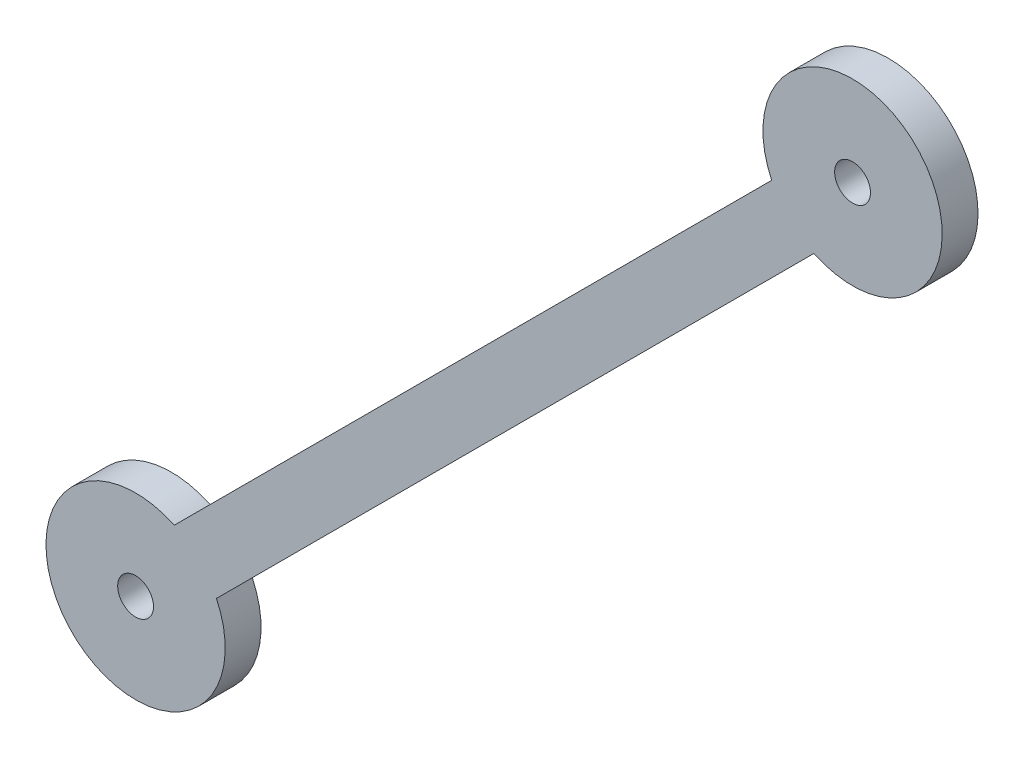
ISO-10303-21;
HEADER;
FILE_DESCRIPTION(('STEP AP214'),'2;1');
FILE_NAME('part.step','',(''),(''),'','','');
FILE_SCHEMA(('AUTOMOTIVE_DESIGN { 1 0 10303 214 1 1 1 1 }'));
ENDSEC;
DATA;
#1=APPLICATION_CONTEXT('core data for automotive mechanical design processes');
#2=APPLICATION_PROTOCOL_DEFINITION('international standard','automotive_design',2000,#1);
#3=PRODUCT_CONTEXT('',#1,'mechanical');
#4=PRODUCT('Part','Part','',(#3));
#5=PRODUCT_RELATED_PRODUCT_CATEGORY('part','',(#4));
#6=PRODUCT_DEFINITION_FORMATION('','',#4);
#7=PRODUCT_DEFINITION_CONTEXT('part definition',#1,'design');
#8=PRODUCT_DEFINITION('design','',#6,#7);
#9=PRODUCT_DEFINITION_SHAPE('','',#8);
#10=(LENGTH_UNIT() NAMED_UNIT(*) SI_UNIT(.MILLI.,.METRE.));
#11=(NAMED_UNIT(*) PLANE_ANGLE_UNIT() SI_UNIT($,.RADIAN.));
#12=(NAMED_UNIT(*) SI_UNIT($,.STERADIAN.) SOLID_ANGLE_UNIT());
#13=UNCERTAINTY_MEASURE_WITH_UNIT(LENGTH_MEASURE(1.E-05),#10,'distance_accuracy_value','');
#14=(GEOMETRIC_REPRESENTATION_CONTEXT(3) GLOBAL_UNCERTAINTY_ASSIGNED_CONTEXT((#13)) GLOBAL_UNIT_ASSIGNED_CONTEXT((#10,
#11,#12)) REPRESENTATION_CONTEXT('',''));
#15=CARTESIAN_POINT('',(0.,0.,0.));
#16=DIRECTION('',(0.,0.,1.));
#17=DIRECTION('',(1.,0.,0.));
#18=AXIS2_PLACEMENT_3D('',#15,#16,#17);
#19=CARTESIAN_POINT('',(0.,0.,6.));
#20=DIRECTION('',(0.,0.,1.));
#21=DIRECTION('',(1.,0.,0.));
#22=AXIS2_PLACEMENT_3D('',#19,#20,#21);
#23=PLANE('',#22);
#24=CARTESIAN_POINT('',(0.,0.,6.));
#25=DIRECTION('',(0.,0.,1.));
#26=DIRECTION('',(1.,0.,0.));
#27=AXIS2_PLACEMENT_3D('',#24,#25,#26);
#28=CIRCLE('',#27,3.);
#29=CARTESIAN_POINT('',(3.,0.,6.));
#30=VERTEX_POINT('',#29);
#31=EDGE_CURVE('E85',#30,#30,#28,.T.);
#32=ORIENTED_EDGE('',*,*,#31,.F.);
#33=EDGE_LOOP('',(#32));
#34=FACE_BOUND('',#33,.T.);
#35=CARTESIAN_POINT('',(0.,0.,6.));
#36=DIRECTION('',(0.,0.,1.));
#37=DIRECTION('',(1.,0.,0.));
#38=AXIS2_PLACEMENT_3D('',#35,#36,#37);
#39=CIRCLE('',#38,15.);
#40=CARTESIAN_POINT('',(6.46446609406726,13.5355339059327,6.));
#41=VERTEX_POINT('',#40);
#42=CARTESIAN_POINT('',(13.5355339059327,6.46446609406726,6.));
#43=VERTEX_POINT('',#42);
#44=EDGE_CURVE('E95',#41,#43,#39,.T.);
#45=ORIENTED_EDGE('',*,*,#44,.T.);
#46=DIRECTION('',(0.707106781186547,0.707106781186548,0.));
#47=VECTOR('',#46,1.);
#48=CARTESIAN_POINT('',(113.535533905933,106.464466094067,6.));
#49=LINE('',#48,#47);
#50=CARTESIAN_POINT('',(113.535533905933,106.464466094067,6.));
#51=VERTEX_POINT('',#50);
#52=EDGE_CURVE('E80',#43,#51,#49,.T.);
#53=ORIENTED_EDGE('',*,*,#52,.T.);
#54=CARTESIAN_POINT('',(120.,120.,6.));
#55=DIRECTION('',(0.,0.,1.));
#56=DIRECTION('',(1.,0.,0.));
#57=AXIS2_PLACEMENT_3D('',#54,#55,#56);
#58=CIRCLE('',#57,15.);
#59=CARTESIAN_POINT('',(106.464466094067,113.535533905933,6.));
#60=VERTEX_POINT('',#59);
#61=EDGE_CURVE('E46',#51,#60,#58,.T.);
#62=ORIENTED_EDGE('',*,*,#61,.T.);
#63=DIRECTION('',(-0.707106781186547,-0.707106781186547,0.));
#64=VECTOR('',#63,1.);
#65=CARTESIAN_POINT('',(6.46446609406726,13.5355339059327,6.));
#66=LINE('',#65,#64);
#67=EDGE_CURVE('E41',#60,#41,#66,.T.);
#68=ORIENTED_EDGE('',*,*,#67,.T.);
#69=EDGE_LOOP('',(#45,#53,#62,#68));
#70=FACE_BOUND('',#69,.T.);
#71=CARTESIAN_POINT('',(120.,120.,6.));
#72=DIRECTION('',(0.,0.,1.));
#73=DIRECTION('',(1.,0.,0.));
#74=AXIS2_PLACEMENT_3D('',#71,#72,#73);
#75=CIRCLE('',#74,3.00000000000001);
#76=CARTESIAN_POINT('',(123.,120.,6.));
#77=VERTEX_POINT('',#76);
#78=EDGE_CURVE('E113',#77,#77,#75,.T.);
#79=ORIENTED_EDGE('',*,*,#78,.F.);
#80=EDGE_LOOP('',(#79));
#81=FACE_BOUND('',#80,.T.);
#82=ADVANCED_FACE('F26',(#34,#70,#81),#23,.T.);
#83=CARTESIAN_POINT('',(0.,0.,0.));
#84=DIRECTION('',(0.,0.,1.));
#85=DIRECTION('',(1.,0.,0.));
#86=AXIS2_PLACEMENT_3D('',#83,#84,#85);
#87=PLANE('',#86);
#88=CARTESIAN_POINT('',(0.,0.,0.));
#89=DIRECTION('',(0.,0.,1.));
#90=DIRECTION('',(1.,0.,0.));
#91=AXIS2_PLACEMENT_3D('',#88,#89,#90);
#92=CIRCLE('',#91,3.);
#93=CARTESIAN_POINT('',(3.,0.,0.));
#94=VERTEX_POINT('',#93);
#95=EDGE_CURVE('E88',#94,#94,#92,.T.);
#96=ORIENTED_EDGE('',*,*,#95,.T.);
#97=EDGE_LOOP('',(#96));
#98=FACE_BOUND('',#97,.T.);
#99=CARTESIAN_POINT('',(0.,0.,0.));
#100=DIRECTION('',(0.,0.,1.));
#101=DIRECTION('',(1.,0.,0.));
#102=AXIS2_PLACEMENT_3D('',#99,#100,#101);
#103=CIRCLE('',#102,15.);
#104=CARTESIAN_POINT('',(6.46446609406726,13.5355339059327,0.));
#105=VERTEX_POINT('',#104);
#106=CARTESIAN_POINT('',(13.5355339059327,6.46446609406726,0.));
#107=VERTEX_POINT('',#106);
#108=EDGE_CURVE('E72',#105,#107,#103,.T.);
#109=ORIENTED_EDGE('',*,*,#108,.F.);
#110=DIRECTION('',(-0.707106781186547,-0.707106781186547,0.));
#111=VECTOR('',#110,1.);
#112=CARTESIAN_POINT('',(6.46446609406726,13.5355339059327,0.));
#113=LINE('',#112,#111);
#114=CARTESIAN_POINT('',(106.464466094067,113.535533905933,0.));
#115=VERTEX_POINT('',#114);
#116=EDGE_CURVE('E93',#115,#105,#113,.T.);
#117=ORIENTED_EDGE('',*,*,#116,.F.);
#118=CARTESIAN_POINT('',(120.,120.,0.));
#119=DIRECTION('',(0.,0.,1.));
#120=DIRECTION('',(1.,0.,0.));
#121=AXIS2_PLACEMENT_3D('',#118,#119,#120);
#122=CIRCLE('',#121,15.);
#123=CARTESIAN_POINT('',(113.535533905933,106.464466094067,0.));
#124=VERTEX_POINT('',#123);
#125=EDGE_CURVE('E73',#124,#115,#122,.T.);
#126=ORIENTED_EDGE('',*,*,#125,.F.);
#127=DIRECTION('',(0.707106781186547,0.707106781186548,0.));
#128=VECTOR('',#127,1.);
#129=CARTESIAN_POINT('',(113.535533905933,106.464466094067,0.));
#130=LINE('',#129,#128);
#131=EDGE_CURVE('E67',#107,#124,#130,.T.);
#132=ORIENTED_EDGE('',*,*,#131,.F.);
#133=EDGE_LOOP('',(#109,#117,#126,#132));
#134=FACE_BOUND('',#133,.T.);
#135=CARTESIAN_POINT('',(120.,120.,0.));
#136=DIRECTION('',(0.,0.,1.));
#137=DIRECTION('',(1.,0.,0.));
#138=AXIS2_PLACEMENT_3D('',#135,#136,#137);
#139=CIRCLE('',#138,3.00000000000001);
#140=CARTESIAN_POINT('',(123.,120.,0.));
#141=VERTEX_POINT('',#140);
#142=EDGE_CURVE('E115',#141,#141,#139,.T.);
#143=ORIENTED_EDGE('',*,*,#142,.T.);
#144=EDGE_LOOP('',(#143));
#145=FACE_BOUND('',#144,.T.);
#146=ADVANCED_FACE('F68',(#98,#134,#145),#87,.F.);
#147=CARTESIAN_POINT('',(0.,0.,6.));
#148=DIRECTION('',(0.,0.,-1.));
#149=DIRECTION('',(-1.,0.,0.));
#150=AXIS2_PLACEMENT_3D('',#147,#148,#149);
#151=CYLINDRICAL_SURFACE('',#150,15.);
#152=ORIENTED_EDGE('',*,*,#108,.T.);
#153=DIRECTION('',(0.,0.,-1.));
#154=VECTOR('',#153,1.);
#155=CARTESIAN_POINT('',(13.5355339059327,6.46446609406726,6.));
#156=LINE('',#155,#154);
#157=EDGE_CURVE('E11',#43,#107,#156,.T.);
#158=ORIENTED_EDGE('',*,*,#157,.F.);
#159=ORIENTED_EDGE('',*,*,#44,.F.);
#160=DIRECTION('',(0.,0.,-1.));
#161=VECTOR('',#160,1.);
#162=CARTESIAN_POINT('',(6.46446609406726,13.5355339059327,6.));
#163=LINE('',#162,#161);
#164=EDGE_CURVE('E84',#41,#105,#163,.T.);
#165=ORIENTED_EDGE('',*,*,#164,.T.);
#166=EDGE_LOOP('',(#152,#158,#159,#165));
#167=FACE_BOUND('',#166,.T.);
#168=ADVANCED_FACE('F28',(#167),#151,.T.);
#169=CARTESIAN_POINT('',(113.535533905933,106.464466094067,6.));
#170=DIRECTION('',(-0.707106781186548,0.707106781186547,0.));
#171=DIRECTION('',(-0.707106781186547,-0.707106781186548,0.));
#172=AXIS2_PLACEMENT_3D('',#169,#170,#171);
#173=PLANE('',#172);
#174=ORIENTED_EDGE('',*,*,#131,.T.);
#175=DIRECTION('',(0.,0.,-1.));
#176=VECTOR('',#175,1.);
#177=CARTESIAN_POINT('',(113.535533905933,106.464466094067,6.));
#178=LINE('',#177,#176);
#179=EDGE_CURVE('E34',#51,#124,#178,.T.);
#180=ORIENTED_EDGE('',*,*,#179,.F.);
#181=ORIENTED_EDGE('',*,*,#52,.F.);
#182=ORIENTED_EDGE('',*,*,#157,.T.);
#183=EDGE_LOOP('',(#174,#180,#181,#182));
#184=FACE_BOUND('',#183,.T.);
#185=ADVANCED_FACE('F79',(#184),#173,.F.);
#186=CARTESIAN_POINT('',(120.,120.,6.));
#187=DIRECTION('',(0.,0.,-1.));
#188=DIRECTION('',(-1.,0.,0.));
#189=AXIS2_PLACEMENT_3D('',#186,#187,#188);
#190=CYLINDRICAL_SURFACE('',#189,15.);
#191=ORIENTED_EDGE('',*,*,#125,.T.);
#192=DIRECTION('',(0.,0.,-1.));
#193=VECTOR('',#192,1.);
#194=CARTESIAN_POINT('',(106.464466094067,113.535533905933,6.));
#195=LINE('',#194,#193);
#196=EDGE_CURVE('E101',#60,#115,#195,.T.);
#197=ORIENTED_EDGE('',*,*,#196,.F.);
#198=ORIENTED_EDGE('',*,*,#61,.F.);
#199=ORIENTED_EDGE('',*,*,#179,.T.);
#200=EDGE_LOOP('',(#191,#197,#198,#199));
#201=FACE_BOUND('',#200,.T.);
#202=ADVANCED_FACE('F104',(#201),#190,.T.);
#203=CARTESIAN_POINT('',(6.46446609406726,13.5355339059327,6.));
#204=DIRECTION('',(0.707106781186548,-0.707106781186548,0.));
#205=DIRECTION('',(0.707106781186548,0.707106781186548,0.));
#206=AXIS2_PLACEMENT_3D('',#203,#204,#205);
#207=PLANE('',#206);
#208=ORIENTED_EDGE('',*,*,#116,.T.);
#209=ORIENTED_EDGE('',*,*,#164,.F.);
#210=ORIENTED_EDGE('',*,*,#67,.F.);
#211=ORIENTED_EDGE('',*,*,#196,.T.);
#212=EDGE_LOOP('',(#208,#209,#210,#211));
#213=FACE_BOUND('',#212,.T.);
#214=ADVANCED_FACE('F106',(#213),#207,.F.);
#215=CARTESIAN_POINT('',(0.,0.,6.));
#216=DIRECTION('',(0.,0.,-1.));
#217=DIRECTION('',(-1.,0.,0.));
#218=AXIS2_PLACEMENT_3D('',#215,#216,#217);
#219=CYLINDRICAL_SURFACE('',#218,3.);
#220=ORIENTED_EDGE('',*,*,#31,.T.);
#221=EDGE_LOOP('',(#220));
#222=FACE_BOUND('',#221,.T.);
#223=ORIENTED_EDGE('',*,*,#95,.F.);
#224=EDGE_LOOP('',(#223));
#225=FACE_BOUND('',#224,.T.);
#226=ADVANCED_FACE('F124',(#222,#225),#219,.F.);
#227=CARTESIAN_POINT('',(120.,120.,6.));
#228=DIRECTION('',(0.,0.,-1.));
#229=DIRECTION('',(-1.,0.,0.));
#230=AXIS2_PLACEMENT_3D('',#227,#228,#229);
#231=CYLINDRICAL_SURFACE('',#230,3.00000000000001);
#232=ORIENTED_EDGE('',*,*,#78,.T.);
#233=EDGE_LOOP('',(#232));
#234=FACE_BOUND('',#233,.T.);
#235=ORIENTED_EDGE('',*,*,#142,.F.);
#236=EDGE_LOOP('',(#235));
#237=FACE_BOUND('',#236,.T.);
#238=ADVANCED_FACE('F122',(#234,#237),#231,.F.);
#239=CLOSED_SHELL('',(#82,#146,#168,#185,#202,#214,#226,#238));
#240=MANIFOLD_SOLID_BREP('B2',#239);
#241=ADVANCED_BREP_SHAPE_REPRESENTATION('',(#18,#240),#14);
#242=SHAPE_DEFINITION_REPRESENTATION(#9,#241);
ENDSEC;
END-ISO-10303-21;
